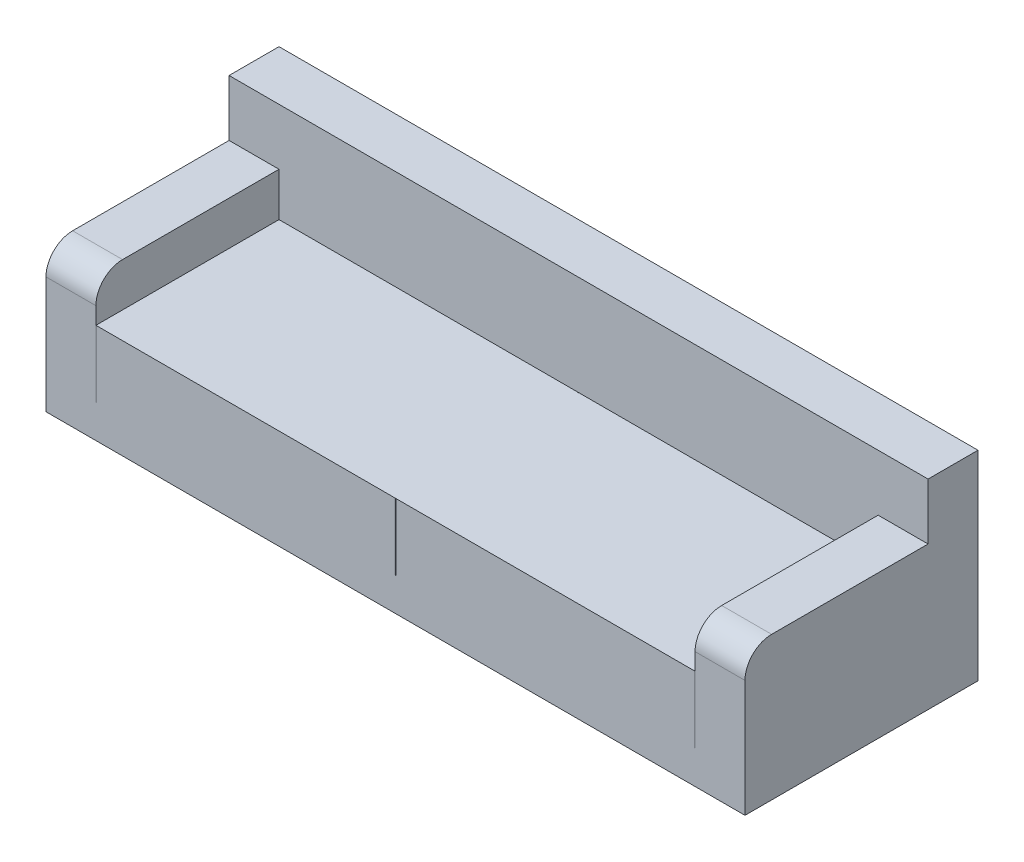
from build123d import *

# Parameters (mm, degrees)
ESQUISSE1_W                      = 900
ESQUISSE1_H                      = 550
BOSS_EXTRU_1_DEPTH               = 200
CONG_1_R                         = 1
R_P_TITION_LIN_AIRE3_COUNT       = 2
R_P_TITION_LIN_AIRE3_PITCH       = 900
CONG_1_OF_R_P_TITION_LIN_AIRE3_R = 1
ESQUISSE2_W                      = 2100
ESQUISSE2_H                      = 550
BOSS_EXTRU_2_DEPTH               = 100
ESQUISSE3_W                      = 150
ESQUISSE3_H                      = 550
BOSS_EXTRU_3_DEPTH               = 331
CONG_2_R                         = 80
ESQUISSE4_W                      = 2100
ESQUISSE4_H                      = 600
BOSS_EXTRU_4_DEPTH               = 150
ESQUISSE5_R                      = 50
BOSS_EXTRU_5_DEPTH               = 50


with BuildPart() as part:
    # Esquisse1 → Boss.-Extru.1 (new body)
    with BuildSketch(Plane(origin=(0, 0, 0), x_dir=(1, 0, 0), z_dir=(0, 1, 0))):
        Rectangle(ESQUISSE1_W, ESQUISSE1_H)
    boss_extru_1 = extrude(amount=BOSS_EXTRU_1_DEPTH)

    # Cong_1
    cong_1_edges = [part.edges().sort_by_distance(p)[0] for p in [
        (450, 100, 275),
        (-450, 100, 275),
        (-450, 100, -275),
        (450, 100, -275),
    ]]
    fillet(cong_1_edges, radius=CONG_1_R)


with BuildPart() as r_p_tition_lin_aire3_1:
    # R_p_tition lin_aire3: Boss.-Extru.1 ×2
    with Locations(*[(i * R_P_TITION_LIN_AIRE3_PITCH, 0, 0) for i in range(1, R_P_TITION_LIN_AIRE3_COUNT)]):
        add(boss_extru_1)

    # Cong_1 of R_p_tition lin_aire3
    cong_1_of_r_p_tition_lin_aire3_edges = [r_p_tition_lin_aire3_1.edges().sort_by_distance(p)[0] for p in [
        (1350, 100, 275),
        (450, 100, 275),
        (450, 100, -275),
        (1350, 100, -275),
    ]]
    fillet(cong_1_of_r_p_tition_lin_aire3_edges, radius=CONG_1_OF_R_P_TITION_LIN_AIRE3_R)


with BuildPart() as part_1:
    add(part.part)

    # R_p_tition lin_aire3 united with what th: union R_p_tition lin_aire3_1
    add(r_p_tition_lin_aire3_1.part)

    # Esquisse2 → Boss.-Extru.2 (add)
    with BuildSketch(Plane.XZ):
        with Locations((450, 0)):
            Rectangle(ESQUISSE2_W, ESQUISSE2_H)
    extrude(amount=BOSS_EXTRU_2_DEPTH)

    # Esquisse3 → Boss.-Extru.3 (add)
    with BuildSketch(Plane(origin=(0, 0, 0), x_dir=(1, 0, 0), z_dir=(0, 1, 0))):
        with Locations((1425, 0)):
            Rectangle(ESQUISSE3_W, ESQUISSE3_H)
        with Locations((-525, 0)):
            Rectangle(ESQUISSE3_W, ESQUISSE3_H)
    extrude(amount=BOSS_EXTRU_3_DEPTH)

    # Cong_2
    cong_2_edges = [part_1.edges().sort_by_distance(p)[0] for p in [
        (1425, 331, 275),
        (-525, 331, 275),
    ]]
    fillet(cong_2_edges, radius=CONG_2_R)

    # Esquisse4 → Boss.-Extru.4 (add)
    with BuildSketch(Plane(origin=(0, 0, -275), x_dir=(-1, 0, 0), z_dir=(0, 0, -1))):
        with Locations((-450, 200)):
            Rectangle(ESQUISSE4_W, ESQUISSE4_H)
    extrude(amount=BOSS_EXTRU_4_DEPTH)

    # Esquisse5 → Boss.-Extru.5 (add)
    with BuildSketch(Plane.XZ.offset(100)):
        with Locations(Location((-500, 175, 0), (0, 0, 90))):
            Circle(ESQUISSE5_R)
        with Locations(Location((1400, 175, 0), (0, 0, 90))):
            Circle(ESQUISSE5_R)
        with Locations(Location((1400, -325, 0), (0, 0, 90))):
            Circle(ESQUISSE5_R)
        with Locations(Location((-500, -325, 0), (0, 0, 90))):
            Circle(ESQUISSE5_R)
    extrude(amount=BOSS_EXTRU_5_DEPTH)


solid = part_1.part
